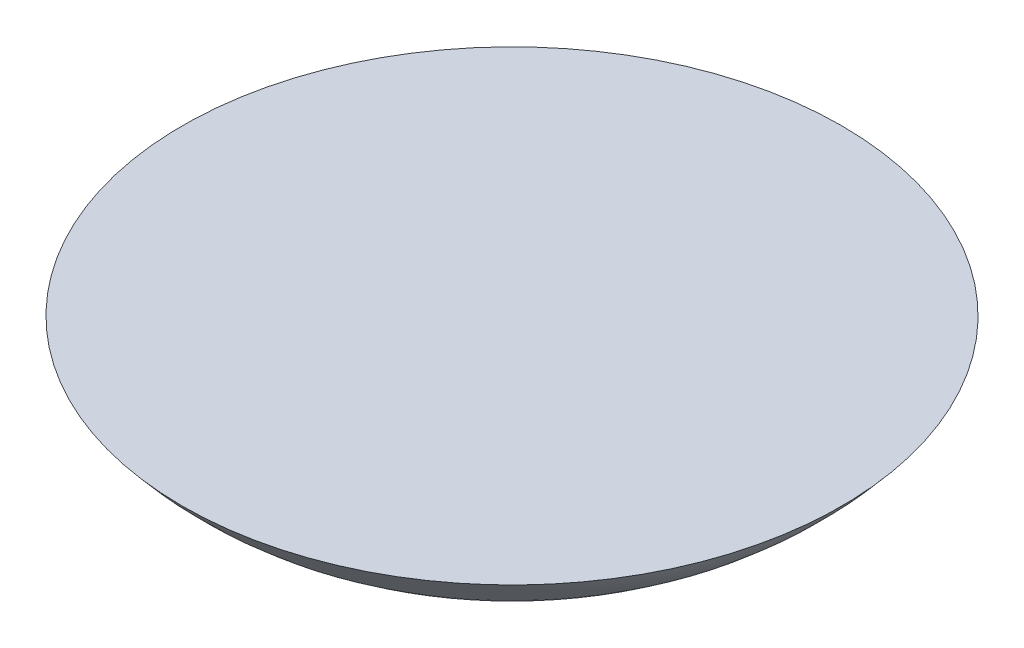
ISO-10303-21;
HEADER;
FILE_DESCRIPTION(('STEP AP214'),'2;1');
FILE_NAME('part.step','',(''),(''),'','','');
FILE_SCHEMA(('AUTOMOTIVE_DESIGN { 1 0 10303 214 1 1 1 1 }'));
ENDSEC;
DATA;
#1=APPLICATION_CONTEXT('core data for automotive mechanical design processes');
#2=APPLICATION_PROTOCOL_DEFINITION('international standard','automotive_design',2000,#1);
#3=PRODUCT_CONTEXT('',#1,'mechanical');
#4=PRODUCT('Part','Part','',(#3));
#5=PRODUCT_RELATED_PRODUCT_CATEGORY('part','',(#4));
#6=PRODUCT_DEFINITION_FORMATION('','',#4);
#7=PRODUCT_DEFINITION_CONTEXT('part definition',#1,'design');
#8=PRODUCT_DEFINITION('design','',#6,#7);
#9=PRODUCT_DEFINITION_SHAPE('','',#8);
#10=(LENGTH_UNIT() NAMED_UNIT(*) SI_UNIT(.MILLI.,.METRE.));
#11=(NAMED_UNIT(*) PLANE_ANGLE_UNIT() SI_UNIT($,.RADIAN.));
#12=(NAMED_UNIT(*) SI_UNIT($,.STERADIAN.) SOLID_ANGLE_UNIT());
#13=UNCERTAINTY_MEASURE_WITH_UNIT(LENGTH_MEASURE(1.E-05),#10,'distance_accuracy_value','');
#14=(GEOMETRIC_REPRESENTATION_CONTEXT(3) GLOBAL_UNCERTAINTY_ASSIGNED_CONTEXT((#13)) GLOBAL_UNIT_ASSIGNED_CONTEXT((#10,
#11,#12)) REPRESENTATION_CONTEXT('',''));
#15=CARTESIAN_POINT('',(0.,0.,0.));
#16=DIRECTION('',(0.,0.,1.));
#17=DIRECTION('',(1.,0.,0.));
#18=AXIS2_PLACEMENT_3D('',#15,#16,#17);
#19=CARTESIAN_POINT('',(0.,-1.5,0.));
#20=DIRECTION('',(0.,1.,0.));
#21=DIRECTION('',(0.,0.,1.));
#22=AXIS2_PLACEMENT_3D('',#19,#20,#21);
#23=PLANE('',#22);
#24=CARTESIAN_POINT('',(0.,-1.5,0.));
#25=DIRECTION('',(0.,1.,0.));
#26=DIRECTION('',(0.,0.,1.));
#27=AXIS2_PLACEMENT_3D('',#24,#25,#26);
#28=CIRCLE('',#27,1.3775010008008);
#29=CARTESIAN_POINT('',(0.,-1.5,1.3775010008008));
#30=VERTEX_POINT('',#29);
#31=EDGE_CURVE('E10',#30,#30,#28,.F.);
#32=ORIENTED_EDGE('',*,*,#31,.T.);
#33=EDGE_LOOP('',(#32));
#34=FACE_BOUND('',#33,.T.);
#35=ADVANCED_FACE('F30',(#34),#23,.F.);
#36=CARTESIAN_POINT('',(0.,0.,0.));
#37=DIRECTION('',(0.,1.,0.));
#38=DIRECTION('',(0.,0.,1.));
#39=AXIS2_PLACEMENT_3D('',#36,#37,#38);
#40=PLANE('',#39);
#41=CARTESIAN_POINT('',(0.,0.,0.));
#42=DIRECTION('',(0.,1.,0.));
#43=DIRECTION('',(0.,0.,1.));
#44=AXIS2_PLACEMENT_3D('',#41,#42,#43);
#45=CIRCLE('',#44,4.5);
#46=CARTESIAN_POINT('',(0.,0.,4.5));
#47=VERTEX_POINT('',#46);
#48=EDGE_CURVE('E37',#47,#47,#45,.T.);
#49=ORIENTED_EDGE('',*,*,#48,.T.);
#50=EDGE_LOOP('',(#49));
#51=FACE_BOUND('',#50,.T.);
#52=ADVANCED_FACE('F43',(#51),#40,.T.);
#53=CARTESIAN_POINT('',(0.,2.5,0.));
#54=DIRECTION('',(0.,-1.,0.));
#55=DIRECTION('',(0.,0.,-1.));
#56=AXIS2_PLACEMENT_3D('',#53,#54,#55);
#57=DEGENERATE_TOROIDAL_SURFACE('',#56,1.3775010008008,4.,.T.);
#58=ORIENTED_EDGE('',*,*,#31,.F.);
#59=EDGE_LOOP('',(#58));
#60=FACE_BOUND('',#59,.T.);
#61=ORIENTED_EDGE('',*,*,#48,.F.);
#62=EDGE_LOOP('',(#61));
#63=FACE_BOUND('',#62,.T.);
#64=ADVANCED_FACE('F32',(#60,#63),#57,.T.);
#65=CLOSED_SHELL('',(#35,#52,#64));
#66=MANIFOLD_SOLID_BREP('B2',#65);
#67=ADVANCED_BREP_SHAPE_REPRESENTATION('',(#18,#66),#14);
#68=SHAPE_DEFINITION_REPRESENTATION(#9,#67);
ENDSEC;
END-ISO-10303-21;
